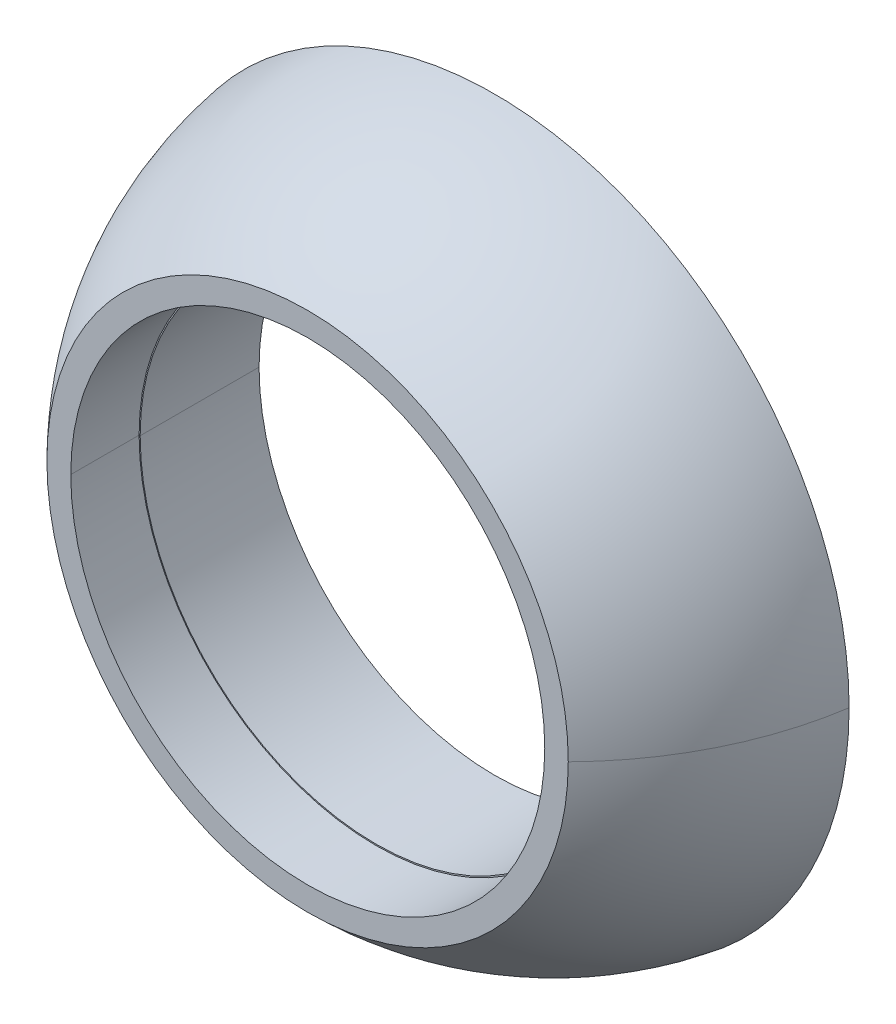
ISO-10303-21;
HEADER;
FILE_DESCRIPTION(('STEP AP214'),'2;1');
FILE_NAME('part.step','',(''),(''),'','','');
FILE_SCHEMA(('AUTOMOTIVE_DESIGN { 1 0 10303 214 1 1 1 1 }'));
ENDSEC;
DATA;
#1=APPLICATION_CONTEXT('core data for automotive mechanical design processes');
#2=APPLICATION_PROTOCOL_DEFINITION('international standard','automotive_design',2000,#1);
#3=PRODUCT_CONTEXT('',#1,'mechanical');
#4=PRODUCT('Part','Part','',(#3));
#5=PRODUCT_RELATED_PRODUCT_CATEGORY('part','',(#4));
#6=PRODUCT_DEFINITION_FORMATION('','',#4);
#7=PRODUCT_DEFINITION_CONTEXT('part definition',#1,'design');
#8=PRODUCT_DEFINITION('design','',#6,#7);
#9=PRODUCT_DEFINITION_SHAPE('','',#8);
#10=(LENGTH_UNIT() NAMED_UNIT(*) SI_UNIT(.MILLI.,.METRE.));
#11=(NAMED_UNIT(*) PLANE_ANGLE_UNIT() SI_UNIT($,.RADIAN.));
#12=(NAMED_UNIT(*) SI_UNIT($,.STERADIAN.) SOLID_ANGLE_UNIT());
#13=UNCERTAINTY_MEASURE_WITH_UNIT(LENGTH_MEASURE(1.E-05),#10,'distance_accuracy_value','');
#14=(GEOMETRIC_REPRESENTATION_CONTEXT(3) GLOBAL_UNCERTAINTY_ASSIGNED_CONTEXT((#13)) GLOBAL_UNIT_ASSIGNED_CONTEXT((#10,
#11,#12)) REPRESENTATION_CONTEXT('',''));
#15=CARTESIAN_POINT('',(0.,0.,0.));
#16=DIRECTION('',(0.,0.,1.));
#17=DIRECTION('',(1.,0.,0.));
#18=AXIS2_PLACEMENT_3D('',#15,#16,#17);
#19=CARTESIAN_POINT('',(0.0192110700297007,0.,2.70934060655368));
#20=DIRECTION('',(0.,0.,1.));
#21=DIRECTION('',(1.,0.,0.));
#22=AXIS2_PLACEMENT_3D('',#19,#20,#21);
#23=CYLINDRICAL_SURFACE('',#22,25.4);
#24=CARTESIAN_POINT('',(0.0192110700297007,0.,10.033));
#25=DIRECTION('',(0.,0.,1.));
#26=DIRECTION('',(1.,0.,0.));
#27=AXIS2_PLACEMENT_3D('',#24,#25,#26);
#28=CIRCLE('',#27,25.4);
#29=CARTESIAN_POINT('',(-25.3807889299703,0.,10.033));
#30=VERTEX_POINT('',#29);
#31=CARTESIAN_POINT('',(25.4192110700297,0.,10.033));
#32=VERTEX_POINT('',#31);
#33=EDGE_CURVE('E70',#30,#32,#28,.F.);
#34=ORIENTED_EDGE('',*,*,#33,.F.);
#35=DIRECTION('',(0.,0.,1.));
#36=VECTOR('',#35,1.);
#37=CARTESIAN_POINT('',(-25.3807889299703,-1.77367354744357E-13,2.70934060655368));
#38=LINE('',#37,#36);
#39=CARTESIAN_POINT('',(-25.3807889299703,-1.71727421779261E-13,2.70934060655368));
#40=VERTEX_POINT('',#39);
#41=EDGE_CURVE('E67',#30,#40,#38,.F.);
#42=ORIENTED_EDGE('',*,*,#41,.T.);
#43=CARTESIAN_POINT('',(0.0192110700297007,0.,2.70934060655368));
#44=DIRECTION('',(0.,0.,1.));
#45=DIRECTION('',(1.,0.,0.));
#46=AXIS2_PLACEMENT_3D('',#43,#44,#45);
#47=CIRCLE('',#46,25.4);
#48=CARTESIAN_POINT('',(25.4192110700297,0.,2.70934060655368));
#49=VERTEX_POINT('',#48);
#50=EDGE_CURVE('E19',#49,#40,#47,.T.);
#51=ORIENTED_EDGE('',*,*,#50,.F.);
#52=DIRECTION('',(0.,0.,1.));
#53=VECTOR('',#52,1.);
#54=CARTESIAN_POINT('',(25.4192110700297,0.,2.70934060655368));
#55=LINE('',#54,#53);
#56=EDGE_CURVE('E74',#49,#32,#55,.T.);
#57=ORIENTED_EDGE('',*,*,#56,.T.);
#58=EDGE_LOOP('',(#34,#42,#51,#57));
#59=FACE_BOUND('',#58,.T.);
#60=ADVANCED_FACE('F16',(#59),#23,.F.);
#61=CARTESIAN_POINT('',(0.0192110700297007,0.,2.70934060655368));
#62=DIRECTION('',(0.,0.,1.));
#63=DIRECTION('',(1.,0.,0.));
#64=AXIS2_PLACEMENT_3D('',#61,#62,#63);
#65=CYLINDRICAL_SURFACE('',#64,25.4);
#66=CARTESIAN_POINT('',(0.0192110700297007,0.,2.70934060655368));
#67=DIRECTION('',(0.,0.,1.));
#68=DIRECTION('',(1.,0.,0.));
#69=AXIS2_PLACEMENT_3D('',#66,#67,#68);
#70=CIRCLE('',#69,25.4);
#71=EDGE_CURVE('E77',#40,#49,#70,.T.);
#72=ORIENTED_EDGE('',*,*,#71,.F.);
#73=ORIENTED_EDGE('',*,*,#41,.F.);
#74=CARTESIAN_POINT('',(0.0192110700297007,0.,10.033));
#75=DIRECTION('',(0.,0.,1.));
#76=DIRECTION('',(1.,0.,0.));
#77=AXIS2_PLACEMENT_3D('',#74,#75,#76);
#78=CIRCLE('',#77,25.4);
#79=EDGE_CURVE('E107',#32,#30,#78,.F.);
#80=ORIENTED_EDGE('',*,*,#79,.F.);
#81=ORIENTED_EDGE('',*,*,#56,.F.);
#82=EDGE_LOOP('',(#72,#73,#80,#81));
#83=FACE_BOUND('',#82,.T.);
#84=ADVANCED_FACE('F78',(#83),#65,.F.);
#85=CARTESIAN_POINT('',(0.0192110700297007,0.,2.70934060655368));
#86=DIRECTION('',(0.,0.,1.));
#87=DIRECTION('',(1.,0.,0.));
#88=AXIS2_PLACEMENT_3D('',#85,#86,#87);
#89=PLANE('',#88);
#90=ORIENTED_EDGE('',*,*,#50,.T.);
#91=ORIENTED_EDGE('',*,*,#71,.T.);
#92=EDGE_LOOP('',(#90,#91));
#93=FACE_BOUND('',#92,.T.);
#94=CARTESIAN_POINT('',(0.,0.,2.70934060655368));
#95=DIRECTION('',(0.,0.,-1.));
#96=DIRECTION('',(-1.,0.,0.));
#97=AXIS2_PLACEMENT_3D('',#94,#95,#96);
#98=CIRCLE('',#97,25.2657227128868);
#99=CARTESIAN_POINT('',(-25.2657227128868,1.78750243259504E-13,2.70934060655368));
#100=VERTEX_POINT('',#99);
#101=CARTESIAN_POINT('',(25.2657227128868,0.,2.70934060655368));
#102=VERTEX_POINT('',#101);
#103=EDGE_CURVE('E105',#100,#102,#98,.F.);
#104=ORIENTED_EDGE('',*,*,#103,.F.);
#105=CARTESIAN_POINT('',(0.,0.,2.70934060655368));
#106=DIRECTION('',(0.,0.,-1.));
#107=DIRECTION('',(-1.,0.,0.));
#108=AXIS2_PLACEMENT_3D('',#105,#106,#107);
#109=CIRCLE('',#108,25.2657227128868);
#110=EDGE_CURVE('E102',#102,#100,#109,.F.);
#111=ORIENTED_EDGE('',*,*,#110,.F.);
#112=EDGE_LOOP('',(#104,#111));
#113=FACE_BOUND('',#112,.T.);
#114=ADVANCED_FACE('F80',(#93,#113),#89,.T.);
#115=CARTESIAN_POINT('',(26.6028613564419,0.,10.033));
#116=DIRECTION('',(0.,0.,1.));
#117=DIRECTION('',(1.,0.,0.));
#118=AXIS2_PLACEMENT_3D('',#115,#116,#117);
#119=PLANE('',#118);
#120=CARTESIAN_POINT('',(0.,0.,10.033));
#121=DIRECTION('',(0.,0.,-1.));
#122=DIRECTION('',(-1.,0.,0.));
#123=AXIS2_PLACEMENT_3D('',#120,#121,#122);
#124=CIRCLE('',#123,27.9400000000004);
#125=CARTESIAN_POINT('',(27.9400000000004,0.,10.033));
#126=VERTEX_POINT('',#125);
#127=CARTESIAN_POINT('',(-27.9400000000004,0.,10.033));
#128=VERTEX_POINT('',#127);
#129=EDGE_CURVE('E99',#126,#128,#124,.T.);
#130=ORIENTED_EDGE('',*,*,#129,.F.);
#131=CARTESIAN_POINT('',(0.,0.,10.033));
#132=DIRECTION('',(0.,0.,-1.));
#133=DIRECTION('',(-1.,0.,0.));
#134=AXIS2_PLACEMENT_3D('',#131,#132,#133);
#135=CIRCLE('',#134,27.9400000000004);
#136=EDGE_CURVE('E96',#128,#126,#135,.T.);
#137=ORIENTED_EDGE('',*,*,#136,.F.);
#138=EDGE_LOOP('',(#130,#137));
#139=FACE_BOUND('',#138,.T.);
#140=ORIENTED_EDGE('',*,*,#33,.T.);
#141=ORIENTED_EDGE('',*,*,#79,.T.);
#142=EDGE_LOOP('',(#140,#141));
#143=FACE_BOUND('',#142,.T.);
#144=ADVANCED_FACE('F110',(#139,#143),#119,.T.);
#145=CARTESIAN_POINT('',(0.,0.,2.70934060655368));
#146=DIRECTION('',(0.,0.,-1.));
#147=DIRECTION('',(-1.,0.,0.));
#148=AXIS2_PLACEMENT_3D('',#145,#146,#147);
#149=CYLINDRICAL_SURFACE('',#148,25.2657227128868);
#150=DIRECTION('',(0.,0.,-1.));
#151=VECTOR('',#150,1.);
#152=CARTESIAN_POINT('',(-25.2657227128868,1.82617813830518E-13,0.));
#153=LINE('',#152,#151);
#154=CARTESIAN_POINT('',(-25.2657227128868,0.,-10.033));
#155=VERTEX_POINT('',#154);
#156=EDGE_CURVE('E101',#100,#155,#153,.T.);
#157=ORIENTED_EDGE('',*,*,#156,.F.);
#158=ORIENTED_EDGE('',*,*,#103,.T.);
#159=DIRECTION('',(0.,0.,-1.));
#160=VECTOR('',#159,1.);
#161=CARTESIAN_POINT('',(25.2657227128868,0.,0.));
#162=LINE('',#161,#160);
#163=CARTESIAN_POINT('',(25.2657227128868,0.,-10.033));
#164=VERTEX_POINT('',#163);
#165=EDGE_CURVE('E84',#164,#102,#162,.F.);
#166=ORIENTED_EDGE('',*,*,#165,.F.);
#167=CARTESIAN_POINT('',(0.,0.,-10.033));
#168=DIRECTION('',(0.,0.,-1.));
#169=DIRECTION('',(-1.,0.,0.));
#170=AXIS2_PLACEMENT_3D('',#167,#168,#169);
#171=CIRCLE('',#170,25.2657227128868);
#172=EDGE_CURVE('E92',#155,#164,#171,.F.);
#173=ORIENTED_EDGE('',*,*,#172,.F.);
#174=EDGE_LOOP('',(#157,#158,#166,#173));
#175=FACE_BOUND('',#174,.T.);
#176=ADVANCED_FACE('F112',(#175),#149,.F.);
#177=CARTESIAN_POINT('',(0.,0.,2.70934060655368));
#178=DIRECTION('',(0.,0.,-1.));
#179=DIRECTION('',(-1.,0.,0.));
#180=AXIS2_PLACEMENT_3D('',#177,#178,#179);
#181=CYLINDRICAL_SURFACE('',#180,25.2657227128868);
#182=ORIENTED_EDGE('',*,*,#156,.T.);
#183=CARTESIAN_POINT('',(0.,0.,-10.033));
#184=DIRECTION('',(0.,0.,-1.));
#185=DIRECTION('',(-1.,0.,0.));
#186=AXIS2_PLACEMENT_3D('',#183,#184,#185);
#187=CIRCLE('',#186,25.2657227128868);
#188=EDGE_CURVE('E89',#164,#155,#187,.F.);
#189=ORIENTED_EDGE('',*,*,#188,.F.);
#190=ORIENTED_EDGE('',*,*,#165,.T.);
#191=ORIENTED_EDGE('',*,*,#110,.T.);
#192=EDGE_LOOP('',(#182,#189,#190,#191));
#193=FACE_BOUND('',#192,.T.);
#194=ADVANCED_FACE('F120',(#193),#181,.F.);
#195=CARTESIAN_POINT('',(-2.078101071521,0.,-15.4391994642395));
#196=DIRECTION('',(0.,1.,0.));
#197=DIRECTION('',(-1.,0.,0.));
#198=AXIS2_PLACEMENT_3D('',#195,#196,#197);
#199=CIRCLE('',#198,36.2997350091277);
#200=TRIMMED_CURVE('',#199,(PARAMETER_VALUE(-1.6280760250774)),
(PARAMETER_VALUE(1.6280760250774)),.T.,.PARAMETER.);
#201=CARTESIAN_POINT('',(0.,0.,-15.4391994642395));
#202=DIRECTION('',(0.,0.,-1.));
#203=AXIS1_PLACEMENT('',#201,#202);
#204=SURFACE_OF_REVOLUTION('',#200,#203);
#205=CARTESIAN_POINT('',(2.078101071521,0.,-15.4391994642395));
#206=DIRECTION('',(0.,-1.,0.));
#207=DIRECTION('',(1.,0.,0.));
#208=AXIS2_PLACEMENT_3D('',#205,#206,#207);
#209=CIRCLE('',#208,36.2997350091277);
#210=CARTESIAN_POINT('',(37.9730000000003,0.,-10.033));
#211=VERTEX_POINT('',#210);
#212=EDGE_CURVE('E95',#126,#211,#209,.F.);
#213=ORIENTED_EDGE('',*,*,#212,.F.);
#214=ORIENTED_EDGE('',*,*,#129,.T.);
#215=CARTESIAN_POINT('',(-2.078101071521,0.,-15.4391994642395));
#216=DIRECTION('',(0.,1.,0.));
#217=DIRECTION('',(-1.,0.,0.));
#218=AXIS2_PLACEMENT_3D('',#215,#216,#217);
#219=CIRCLE('',#218,36.2997350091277);
#220=CARTESIAN_POINT('',(-37.9730000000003,0.,-10.033));
#221=VERTEX_POINT('',#220);
#222=EDGE_CURVE('E34',#221,#128,#219,.T.);
#223=ORIENTED_EDGE('',*,*,#222,.F.);
#224=CARTESIAN_POINT('',(0.,0.,-10.033));
#225=DIRECTION('',(0.,0.,-1.));
#226=DIRECTION('',(-1.,0.,0.));
#227=AXIS2_PLACEMENT_3D('',#224,#225,#226);
#228=CIRCLE('',#227,37.9730000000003);
#229=EDGE_CURVE('E25',#211,#221,#228,.T.);
#230=ORIENTED_EDGE('',*,*,#229,.F.);
#231=EDGE_LOOP('',(#213,#214,#223,#230));
#232=FACE_BOUND('',#231,.T.);
#233=ADVANCED_FACE('F132',(#232),#204,.F.);
#234=CARTESIAN_POINT('',(-2.078101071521,0.,-15.4391994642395));
#235=DIRECTION('',(0.,1.,0.));
#236=DIRECTION('',(-1.,0.,0.));
#237=AXIS2_PLACEMENT_3D('',#234,#235,#236);
#238=CIRCLE('',#237,36.2997350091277);
#239=TRIMMED_CURVE('',#238,(PARAMETER_VALUE(-1.6280760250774)),
(PARAMETER_VALUE(1.6280760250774)),.T.,.PARAMETER.);
#240=CARTESIAN_POINT('',(0.,0.,-15.4391994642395));
#241=DIRECTION('',(0.,0.,-1.));
#242=AXIS1_PLACEMENT('',#240,#241);
#243=SURFACE_OF_REVOLUTION('',#239,#242);
#244=ORIENTED_EDGE('',*,*,#212,.T.);
#245=CARTESIAN_POINT('',(0.,0.,-10.033));
#246=DIRECTION('',(0.,0.,-1.));
#247=DIRECTION('',(-1.,0.,0.));
#248=AXIS2_PLACEMENT_3D('',#245,#246,#247);
#249=CIRCLE('',#248,37.9730000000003);
#250=EDGE_CURVE('E11',#221,#211,#249,.T.);
#251=ORIENTED_EDGE('',*,*,#250,.F.);
#252=ORIENTED_EDGE('',*,*,#222,.T.);
#253=ORIENTED_EDGE('',*,*,#136,.T.);
#254=EDGE_LOOP('',(#244,#251,#252,#253));
#255=FACE_BOUND('',#254,.T.);
#256=ADVANCED_FACE('F126',(#255),#243,.F.);
#257=CARTESIAN_POINT('',(31.6193613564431,0.,-10.033));
#258=DIRECTION('',(0.,0.,-1.));
#259=DIRECTION('',(-1.,0.,0.));
#260=AXIS2_PLACEMENT_3D('',#257,#258,#259);
#261=PLANE('',#260);
#262=ORIENTED_EDGE('',*,*,#229,.T.);
#263=ORIENTED_EDGE('',*,*,#250,.T.);
#264=EDGE_LOOP('',(#262,#263));
#265=FACE_BOUND('',#264,.T.);
#266=ORIENTED_EDGE('',*,*,#172,.T.);
#267=ORIENTED_EDGE('',*,*,#188,.T.);
#268=EDGE_LOOP('',(#266,#267));
#269=FACE_BOUND('',#268,.T.);
#270=ADVANCED_FACE('F124',(#265,#269),#261,.T.);
#271=CLOSED_SHELL('',(#60,#84,#114,#144,#176,#194,#233,#256,#270));
#272=MANIFOLD_SOLID_BREP('B1',#271);
#273=ADVANCED_BREP_SHAPE_REPRESENTATION('',(#18,#272),#14);
#274=SHAPE_DEFINITION_REPRESENTATION(#9,#273);
ENDSEC;
END-ISO-10303-21;
